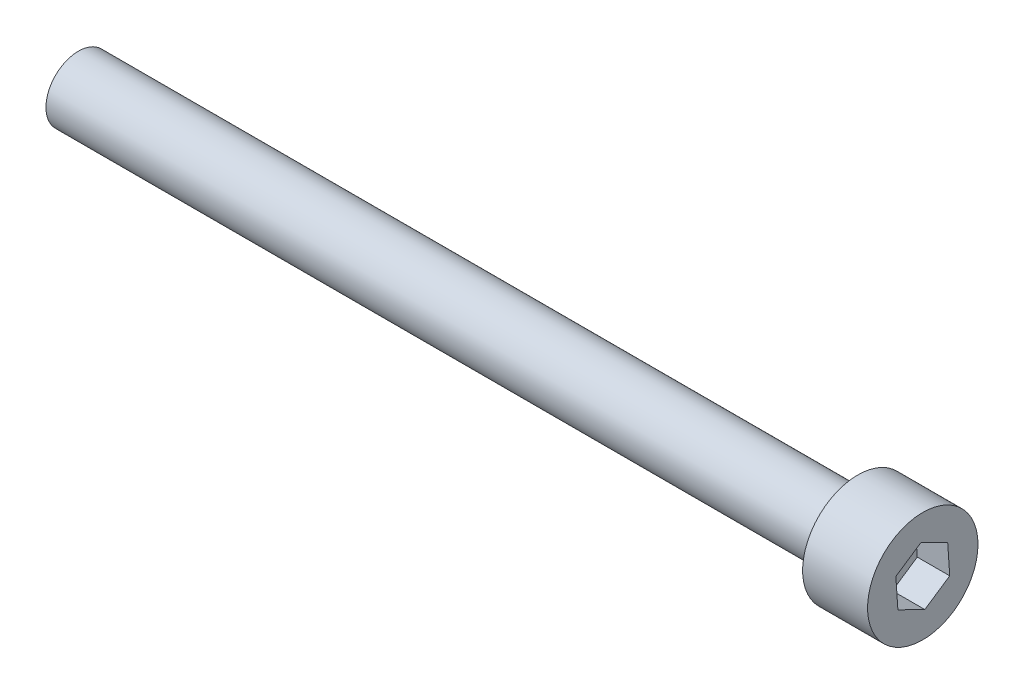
ISO-10303-21;
HEADER;
FILE_DESCRIPTION(('STEP AP214'),'2;1');
FILE_NAME('part.step','',(''),(''),'','','');
FILE_SCHEMA(('AUTOMOTIVE_DESIGN { 1 0 10303 214 1 1 1 1 }'));
ENDSEC;
DATA;
#1=APPLICATION_CONTEXT('core data for automotive mechanical design processes');
#2=APPLICATION_PROTOCOL_DEFINITION('international standard','automotive_design',2000,#1);
#3=PRODUCT_CONTEXT('',#1,'mechanical');
#4=PRODUCT('Part','Part','',(#3));
#5=PRODUCT_RELATED_PRODUCT_CATEGORY('part','',(#4));
#6=PRODUCT_DEFINITION_FORMATION('','',#4);
#7=PRODUCT_DEFINITION_CONTEXT('part definition',#1,'design');
#8=PRODUCT_DEFINITION('design','',#6,#7);
#9=PRODUCT_DEFINITION_SHAPE('','',#8);
#10=(LENGTH_UNIT() NAMED_UNIT(*) SI_UNIT(.MILLI.,.METRE.));
#11=(NAMED_UNIT(*) PLANE_ANGLE_UNIT() SI_UNIT($,.RADIAN.));
#12=(NAMED_UNIT(*) SI_UNIT($,.STERADIAN.) SOLID_ANGLE_UNIT());
#13=UNCERTAINTY_MEASURE_WITH_UNIT(LENGTH_MEASURE(1.E-05),#10,'distance_accuracy_value','');
#14=(GEOMETRIC_REPRESENTATION_CONTEXT(3) GLOBAL_UNCERTAINTY_ASSIGNED_CONTEXT((#13)) GLOBAL_UNIT_ASSIGNED_CONTEXT((#10,
#11,#12)) REPRESENTATION_CONTEXT('',''));
#15=CARTESIAN_POINT('',(0.,0.,0.));
#16=DIRECTION('',(0.,0.,1.));
#17=DIRECTION('',(1.,0.,0.));
#18=AXIS2_PLACEMENT_3D('',#15,#16,#17);
#19=CARTESIAN_POINT('',(0.,0.,0.));
#20=DIRECTION('',(1.,0.,0.));
#21=DIRECTION('',(0.,0.,-1.));
#22=AXIS2_PLACEMENT_3D('',#19,#20,#21);
#23=PLANE('',#22);
#24=DIRECTION('',(0.,0.557571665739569,-0.83012880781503));
#25=VECTOR('',#24,1.);
#26=CARTESIAN_POINT('',(0.,-2.30408591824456,-0.156593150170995));
#27=LINE('',#26,#25);
#28=CARTESIAN_POINT('',(0.,-2.30408591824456,-0.156593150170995));
#29=VERTEX_POINT('',#28);
#30=CARTESIAN_POINT('',(0.,-1.01642931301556,-2.07369351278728));
#31=VERTEX_POINT('',#30);
#32=EDGE_CURVE('E52',#29,#31,#27,.T.);
#33=ORIENTED_EDGE('',*,*,#32,.F.);
#34=DIRECTION('',(0.,-0.440126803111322,-0.897935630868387));
#35=VECTOR('',#34,1.);
#36=CARTESIAN_POINT('',(0.,-1.28765660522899,1.91710036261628));
#37=LINE('',#36,#35);
#38=CARTESIAN_POINT('',(0.,-1.28765660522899,1.91710036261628));
#39=VERTEX_POINT('',#38);
#40=EDGE_CURVE('E135',#39,#29,#37,.T.);
#41=ORIENTED_EDGE('',*,*,#40,.F.);
#42=DIRECTION('',(0.,-0.99769846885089,-0.0678068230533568));
#43=VECTOR('',#42,1.);
#44=CARTESIAN_POINT('',(0.,1.01642931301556,2.07369351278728));
#45=LINE('',#44,#43);
#46=CARTESIAN_POINT('',(0.,1.01642931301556,2.07369351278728));
#47=VERTEX_POINT('',#46);
#48=EDGE_CURVE('E133',#47,#39,#45,.T.);
#49=ORIENTED_EDGE('',*,*,#48,.F.);
#50=DIRECTION('',(0.,-0.557571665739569,0.83012880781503));
#51=VECTOR('',#50,1.);
#52=CARTESIAN_POINT('',(0.,2.30408591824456,0.156593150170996));
#53=LINE('',#52,#51);
#54=CARTESIAN_POINT('',(0.,2.30408591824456,0.156593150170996));
#55=VERTEX_POINT('',#54);
#56=EDGE_CURVE('E100',#55,#47,#53,.T.);
#57=ORIENTED_EDGE('',*,*,#56,.F.);
#58=DIRECTION('',(0.,0.440126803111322,0.897935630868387));
#59=VECTOR('',#58,1.);
#60=CARTESIAN_POINT('',(0.,1.28765660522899,-1.91710036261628));
#61=LINE('',#60,#59);
#62=CARTESIAN_POINT('',(0.,1.28765660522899,-1.91710036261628));
#63=VERTEX_POINT('',#62);
#64=EDGE_CURVE('E129',#63,#55,#61,.T.);
#65=ORIENTED_EDGE('',*,*,#64,.F.);
#66=DIRECTION('',(0.,0.99769846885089,0.067806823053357));
#67=VECTOR('',#66,1.);
#68=CARTESIAN_POINT('',(0.,-1.01642931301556,-2.07369351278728));
#69=LINE('',#68,#67);
#70=EDGE_CURVE('E126',#31,#63,#69,.T.);
#71=ORIENTED_EDGE('',*,*,#70,.F.);
#72=EDGE_LOOP('',(#33,#41,#49,#57,#65,#71));
#73=FACE_BOUND('',#72,.T.);
#74=CARTESIAN_POINT('',(0.,0.,0.));
#75=DIRECTION('',(1.,0.,0.));
#76=DIRECTION('',(0.,0.,-1.));
#77=AXIS2_PLACEMENT_3D('',#74,#75,#76);
#78=CIRCLE('',#77,4.25);
#79=CARTESIAN_POINT('',(0.,0.,-4.25));
#80=VERTEX_POINT('',#79);
#81=EDGE_CURVE('E11',#80,#80,#78,.T.);
#82=ORIENTED_EDGE('',*,*,#81,.T.);
#83=EDGE_LOOP('',(#82));
#84=FACE_BOUND('',#83,.T.);
#85=ADVANCED_FACE('F38',(#73,#84),#23,.T.);
#86=CARTESIAN_POINT('',(0.,0.,0.));
#87=DIRECTION('',(1.,0.,0.));
#88=DIRECTION('',(0.,0.,-1.));
#89=AXIS2_PLACEMENT_3D('',#86,#87,#88);
#90=CYLINDRICAL_SURFACE('',#89,4.25);
#91=CARTESIAN_POINT('',(-5.,0.,0.));
#92=DIRECTION('',(1.,0.,0.));
#93=DIRECTION('',(0.,0.,-1.));
#94=AXIS2_PLACEMENT_3D('',#91,#92,#93);
#95=CIRCLE('',#94,4.25);
#96=CARTESIAN_POINT('',(-5.,0.,-4.25));
#97=VERTEX_POINT('',#96);
#98=EDGE_CURVE('E45',#97,#97,#95,.T.);
#99=ORIENTED_EDGE('',*,*,#98,.T.);
#100=EDGE_LOOP('',(#99));
#101=FACE_BOUND('',#100,.T.);
#102=ORIENTED_EDGE('',*,*,#81,.F.);
#103=EDGE_LOOP('',(#102));
#104=FACE_BOUND('',#103,.T.);
#105=ADVANCED_FACE('F152',(#101,#104),#90,.T.);
#106=CARTESIAN_POINT('',(-5.,4.25,0.));
#107=DIRECTION('',(-1.,0.,0.));
#108=DIRECTION('',(0.,0.,1.));
#109=AXIS2_PLACEMENT_3D('',#106,#107,#108);
#110=PLANE('',#109);
#111=CARTESIAN_POINT('',(-5.,0.,0.));
#112=DIRECTION('',(1.,0.,0.));
#113=DIRECTION('',(0.,0.,-1.));
#114=AXIS2_PLACEMENT_3D('',#111,#112,#113);
#115=CIRCLE('',#114,2.5);
#116=CARTESIAN_POINT('',(-5.,0.,-2.5));
#117=VERTEX_POINT('',#116);
#118=EDGE_CURVE('E147',#117,#117,#115,.T.);
#119=ORIENTED_EDGE('',*,*,#118,.T.);
#120=EDGE_LOOP('',(#119));
#121=FACE_BOUND('',#120,.T.);
#122=ORIENTED_EDGE('',*,*,#98,.F.);
#123=EDGE_LOOP('',(#122));
#124=FACE_BOUND('',#123,.T.);
#125=ADVANCED_FACE('F155',(#121,#124),#110,.T.);
#126=CARTESIAN_POINT('',(0.,0.,0.));
#127=DIRECTION('',(1.,0.,0.));
#128=DIRECTION('',(0.,0.,-1.));
#129=AXIS2_PLACEMENT_3D('',#126,#127,#128);
#130=CYLINDRICAL_SURFACE('',#129,2.5);
#131=CARTESIAN_POINT('',(-65.,0.,0.));
#132=DIRECTION('',(1.,0.,0.));
#133=DIRECTION('',(0.,0.,-1.));
#134=AXIS2_PLACEMENT_3D('',#131,#132,#133);
#135=CIRCLE('',#134,2.49999999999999);
#136=CARTESIAN_POINT('',(-65.,0.,-2.49999999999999));
#137=VERTEX_POINT('',#136);
#138=EDGE_CURVE('E139',#137,#137,#135,.T.);
#139=ORIENTED_EDGE('',*,*,#138,.T.);
#140=EDGE_LOOP('',(#139));
#141=FACE_BOUND('',#140,.T.);
#142=ORIENTED_EDGE('',*,*,#118,.F.);
#143=EDGE_LOOP('',(#142));
#144=FACE_BOUND('',#143,.T.);
#145=ADVANCED_FACE('F157',(#141,#144),#130,.T.);
#146=CARTESIAN_POINT('',(-65.,2.49999999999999,0.));
#147=DIRECTION('',(-1.,0.,0.));
#148=DIRECTION('',(0.,0.,1.));
#149=AXIS2_PLACEMENT_3D('',#146,#147,#148);
#150=PLANE('',#149);
#151=ORIENTED_EDGE('',*,*,#138,.F.);
#152=EDGE_LOOP('',(#151));
#153=FACE_BOUND('',#152,.T.);
#154=ADVANCED_FACE('F164',(#153),#150,.T.);
#155=CARTESIAN_POINT('',(-2.5,-2.30408591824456,-0.156593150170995));
#156=DIRECTION('',(0.,-0.83012880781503,-0.557571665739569));
#157=DIRECTION('',(0.,0.557571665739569,-0.83012880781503));
#158=AXIS2_PLACEMENT_3D('',#155,#156,#157);
#159=PLANE('',#158);
#160=ORIENTED_EDGE('',*,*,#32,.T.);
#161=DIRECTION('',(1.,0.,0.));
#162=VECTOR('',#161,1.);
#163=CARTESIAN_POINT('',(-2.5,-1.01642931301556,-2.07369351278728));
#164=LINE('',#163,#162);
#165=CARTESIAN_POINT('',(-2.5,-1.01642931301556,-2.07369351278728));
#166=VERTEX_POINT('',#165);
#167=EDGE_CURVE('E82',#166,#31,#164,.T.);
#168=ORIENTED_EDGE('',*,*,#167,.F.);
#169=DIRECTION('',(0.,0.557571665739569,-0.83012880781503));
#170=VECTOR('',#169,1.);
#171=CARTESIAN_POINT('',(-2.5,-2.30408591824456,-0.156593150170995));
#172=LINE('',#171,#170);
#173=CARTESIAN_POINT('',(-2.5,-2.30408591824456,-0.156593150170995));
#174=VERTEX_POINT('',#173);
#175=EDGE_CURVE('E137',#174,#166,#172,.T.);
#176=ORIENTED_EDGE('',*,*,#175,.F.);
#177=DIRECTION('',(1.,0.,0.));
#178=VECTOR('',#177,1.);
#179=CARTESIAN_POINT('',(-2.5,-2.30408591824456,-0.156593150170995));
#180=LINE('',#179,#178);
#181=EDGE_CURVE('E60',#174,#29,#180,.T.);
#182=ORIENTED_EDGE('',*,*,#181,.T.);
#183=EDGE_LOOP('',(#160,#168,#176,#182));
#184=FACE_BOUND('',#183,.T.);
#185=ADVANCED_FACE('F179',(#184),#159,.F.);
#186=CARTESIAN_POINT('',(-2.5,-1.28765660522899,1.91710036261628));
#187=DIRECTION('',(0.,-0.897935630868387,0.440126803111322));
#188=DIRECTION('',(0.,-0.440126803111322,-0.897935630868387));
#189=AXIS2_PLACEMENT_3D('',#186,#187,#188);
#190=PLANE('',#189);
#191=ORIENTED_EDGE('',*,*,#40,.T.);
#192=ORIENTED_EDGE('',*,*,#181,.F.);
#193=DIRECTION('',(0.,-0.440126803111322,-0.897935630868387));
#194=VECTOR('',#193,1.);
#195=CARTESIAN_POINT('',(-2.5,-1.28765660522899,1.91710036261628));
#196=LINE('',#195,#194);
#197=CARTESIAN_POINT('',(-2.5,-1.28765660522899,1.91710036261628));
#198=VERTEX_POINT('',#197);
#199=EDGE_CURVE('E112',#198,#174,#196,.T.);
#200=ORIENTED_EDGE('',*,*,#199,.F.);
#201=DIRECTION('',(1.,0.,0.));
#202=VECTOR('',#201,1.);
#203=CARTESIAN_POINT('',(-2.5,-1.28765660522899,1.91710036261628));
#204=LINE('',#203,#202);
#205=EDGE_CURVE('E104',#198,#39,#204,.T.);
#206=ORIENTED_EDGE('',*,*,#205,.T.);
#207=EDGE_LOOP('',(#191,#192,#200,#206));
#208=FACE_BOUND('',#207,.T.);
#209=ADVANCED_FACE('F181',(#208),#190,.F.);
#210=CARTESIAN_POINT('',(-2.5,1.01642931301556,2.07369351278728));
#211=DIRECTION('',(0.,-0.0678068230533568,0.99769846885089));
#212=DIRECTION('',(0.,-0.99769846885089,-0.0678068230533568));
#213=AXIS2_PLACEMENT_3D('',#210,#211,#212);
#214=PLANE('',#213);
#215=ORIENTED_EDGE('',*,*,#48,.T.);
#216=ORIENTED_EDGE('',*,*,#205,.F.);
#217=DIRECTION('',(0.,-0.99769846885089,-0.0678068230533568));
#218=VECTOR('',#217,1.);
#219=CARTESIAN_POINT('',(-2.5,1.01642931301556,2.07369351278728));
#220=LINE('',#219,#218);
#221=CARTESIAN_POINT('',(-2.5,1.01642931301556,2.07369351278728));
#222=VERTEX_POINT('',#221);
#223=EDGE_CURVE('E108',#222,#198,#220,.T.);
#224=ORIENTED_EDGE('',*,*,#223,.F.);
#225=DIRECTION('',(1.,0.,0.));
#226=VECTOR('',#225,1.);
#227=CARTESIAN_POINT('',(-2.5,1.01642931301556,2.07369351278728));
#228=LINE('',#227,#226);
#229=EDGE_CURVE('E93',#222,#47,#228,.T.);
#230=ORIENTED_EDGE('',*,*,#229,.T.);
#231=EDGE_LOOP('',(#215,#216,#224,#230));
#232=FACE_BOUND('',#231,.T.);
#233=ADVANCED_FACE('F109',(#232),#214,.F.);
#234=CARTESIAN_POINT('',(-2.5,2.30408591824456,0.156593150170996));
#235=DIRECTION('',(0.,0.83012880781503,0.557571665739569));
#236=DIRECTION('',(0.,-0.557571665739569,0.83012880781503));
#237=AXIS2_PLACEMENT_3D('',#234,#235,#236);
#238=PLANE('',#237);
#239=ORIENTED_EDGE('',*,*,#56,.T.);
#240=ORIENTED_EDGE('',*,*,#229,.F.);
#241=DIRECTION('',(0.,-0.557571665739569,0.83012880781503));
#242=VECTOR('',#241,1.);
#243=CARTESIAN_POINT('',(-2.5,2.30408591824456,0.156593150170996));
#244=LINE('',#243,#242);
#245=CARTESIAN_POINT('',(-2.5,2.30408591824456,0.156593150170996));
#246=VERTEX_POINT('',#245);
#247=EDGE_CURVE('E97',#246,#222,#244,.T.);
#248=ORIENTED_EDGE('',*,*,#247,.F.);
#249=DIRECTION('',(1.,0.,0.));
#250=VECTOR('',#249,1.);
#251=CARTESIAN_POINT('',(-2.5,2.30408591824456,0.156593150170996));
#252=LINE('',#251,#250);
#253=EDGE_CURVE('E105',#246,#55,#252,.T.);
#254=ORIENTED_EDGE('',*,*,#253,.T.);
#255=EDGE_LOOP('',(#239,#240,#248,#254));
#256=FACE_BOUND('',#255,.T.);
#257=ADVANCED_FACE('F95',(#256),#238,.F.);
#258=CARTESIAN_POINT('',(-2.5,1.28765660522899,-1.91710036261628));
#259=DIRECTION('',(0.,0.897935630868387,-0.440126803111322));
#260=DIRECTION('',(0.,0.440126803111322,0.897935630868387));
#261=AXIS2_PLACEMENT_3D('',#258,#259,#260);
#262=PLANE('',#261);
#263=ORIENTED_EDGE('',*,*,#64,.T.);
#264=ORIENTED_EDGE('',*,*,#253,.F.);
#265=DIRECTION('',(0.,0.440126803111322,0.897935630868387));
#266=VECTOR('',#265,1.);
#267=CARTESIAN_POINT('',(-2.5,1.28765660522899,-1.91710036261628));
#268=LINE('',#267,#266);
#269=CARTESIAN_POINT('',(-2.5,1.28765660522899,-1.91710036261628));
#270=VERTEX_POINT('',#269);
#271=EDGE_CURVE('E118',#270,#246,#268,.T.);
#272=ORIENTED_EDGE('',*,*,#271,.F.);
#273=DIRECTION('',(1.,0.,0.));
#274=VECTOR('',#273,1.);
#275=CARTESIAN_POINT('',(-2.5,1.28765660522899,-1.91710036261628));
#276=LINE('',#275,#274);
#277=EDGE_CURVE('E142',#270,#63,#276,.T.);
#278=ORIENTED_EDGE('',*,*,#277,.T.);
#279=EDGE_LOOP('',(#263,#264,#272,#278));
#280=FACE_BOUND('',#279,.T.);
#281=ADVANCED_FACE('F193',(#280),#262,.F.);
#282=CARTESIAN_POINT('',(-2.5,-1.01642931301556,-2.07369351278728));
#283=DIRECTION('',(0.,0.067806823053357,-0.99769846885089));
#284=DIRECTION('',(0.,0.99769846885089,0.067806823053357));
#285=AXIS2_PLACEMENT_3D('',#282,#283,#284);
#286=PLANE('',#285);
#287=ORIENTED_EDGE('',*,*,#70,.T.);
#288=ORIENTED_EDGE('',*,*,#277,.F.);
#289=DIRECTION('',(0.,0.99769846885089,0.067806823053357));
#290=VECTOR('',#289,1.);
#291=CARTESIAN_POINT('',(-2.5,-1.01642931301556,-2.07369351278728));
#292=LINE('',#291,#290);
#293=EDGE_CURVE('E120',#166,#270,#292,.T.);
#294=ORIENTED_EDGE('',*,*,#293,.F.);
#295=ORIENTED_EDGE('',*,*,#167,.T.);
#296=EDGE_LOOP('',(#287,#288,#294,#295));
#297=FACE_BOUND('',#296,.T.);
#298=ADVANCED_FACE('F177',(#297),#286,.F.);
#299=CARTESIAN_POINT('',(-2.5,-1.01642931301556,-2.07369351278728));
#300=DIRECTION('',(1.,0.,0.));
#301=DIRECTION('',(0.,0.,-1.));
#302=AXIS2_PLACEMENT_3D('',#299,#300,#301);
#303=PLANE('',#302);
#304=ORIENTED_EDGE('',*,*,#175,.T.);
#305=ORIENTED_EDGE('',*,*,#293,.T.);
#306=ORIENTED_EDGE('',*,*,#271,.T.);
#307=ORIENTED_EDGE('',*,*,#247,.T.);
#308=ORIENTED_EDGE('',*,*,#223,.T.);
#309=ORIENTED_EDGE('',*,*,#199,.T.);
#310=EDGE_LOOP('',(#304,#305,#306,#307,#308,#309));
#311=FACE_BOUND('',#310,.T.);
#312=ADVANCED_FACE('F115',(#311),#303,.T.);
#313=CLOSED_SHELL('',(#85,#105,#125,#145,#154,#185,#209,#233,#257,#281,#298,#312));
#314=MANIFOLD_SOLID_BREP('B2',#313);
#315=ADVANCED_BREP_SHAPE_REPRESENTATION('',(#18,#314),#14);
#316=SHAPE_DEFINITION_REPRESENTATION(#9,#315);
ENDSEC;
END-ISO-10303-21;
